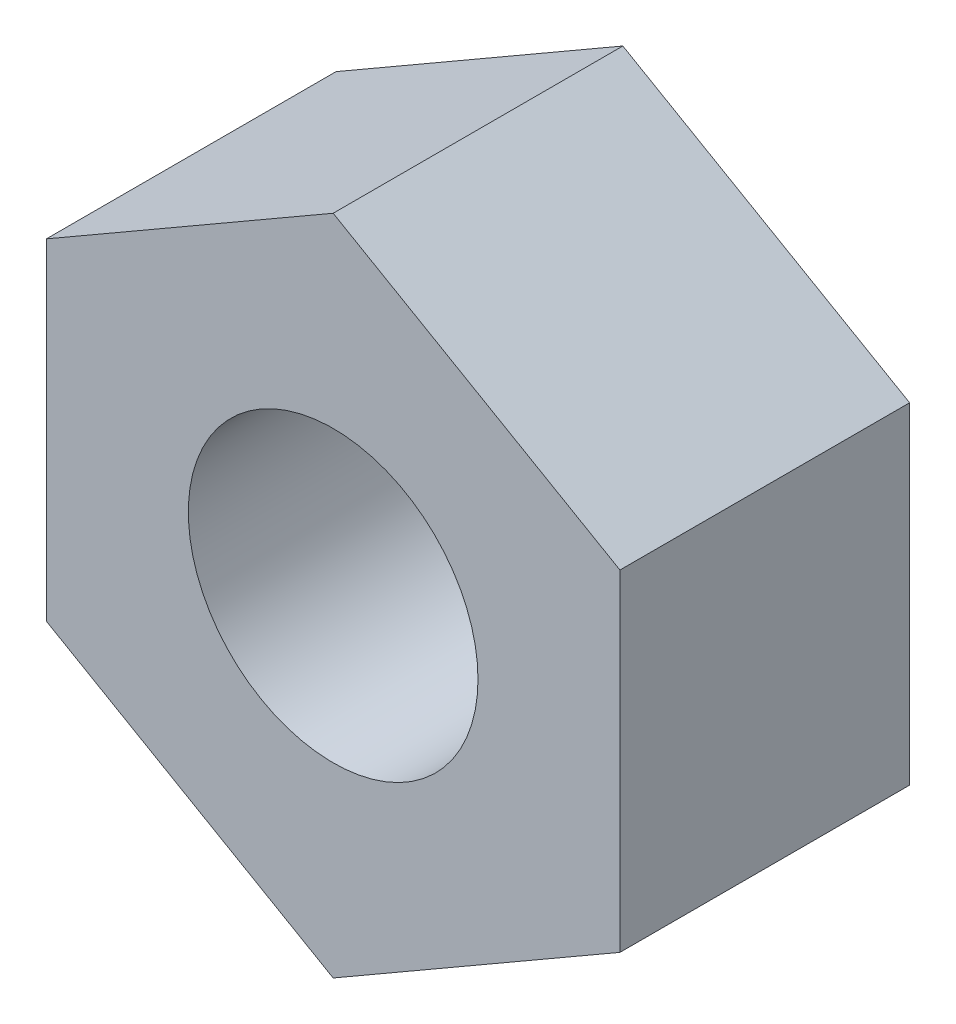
ISO-10303-21;
HEADER;
FILE_DESCRIPTION(('STEP AP214'),'2;1');
FILE_NAME('part.step','',(''),(''),'','','');
FILE_SCHEMA(('AUTOMOTIVE_DESIGN { 1 0 10303 214 1 1 1 1 }'));
ENDSEC;
DATA;
#1=APPLICATION_CONTEXT('core data for automotive mechanical design processes');
#2=APPLICATION_PROTOCOL_DEFINITION('international standard','automotive_design',2000,#1);
#3=PRODUCT_CONTEXT('',#1,'mechanical');
#4=PRODUCT('Part','Part','',(#3));
#5=PRODUCT_RELATED_PRODUCT_CATEGORY('part','',(#4));
#6=PRODUCT_DEFINITION_FORMATION('','',#4);
#7=PRODUCT_DEFINITION_CONTEXT('part definition',#1,'design');
#8=PRODUCT_DEFINITION('design','',#6,#7);
#9=PRODUCT_DEFINITION_SHAPE('','',#8);
#10=(LENGTH_UNIT() NAMED_UNIT(*) SI_UNIT(.MILLI.,.METRE.));
#11=(NAMED_UNIT(*) PLANE_ANGLE_UNIT() SI_UNIT($,.RADIAN.));
#12=(NAMED_UNIT(*) SI_UNIT($,.STERADIAN.) SOLID_ANGLE_UNIT());
#13=UNCERTAINTY_MEASURE_WITH_UNIT(LENGTH_MEASURE(1.E-05),#10,'distance_accuracy_value','');
#14=(GEOMETRIC_REPRESENTATION_CONTEXT(3) GLOBAL_UNCERTAINTY_ASSIGNED_CONTEXT((#13)) GLOBAL_UNIT_ASSIGNED_CONTEXT((#10,
#11,#12)) REPRESENTATION_CONTEXT('',''));
#15=CARTESIAN_POINT('',(0.,0.,0.));
#16=DIRECTION('',(0.,0.,1.));
#17=DIRECTION('',(1.,0.,0.));
#18=AXIS2_PLACEMENT_3D('',#15,#16,#17);
#19=CARTESIAN_POINT('',(9.9,0.,5.));
#20=DIRECTION('',(0.,0.,-1.));
#21=DIRECTION('',(-1.,0.,0.));
#22=AXIS2_PLACEMENT_3D('',#19,#20,#21);
#23=PLANE('',#22);
#24=DIRECTION('',(-0.866025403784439,0.5,0.));
#25=VECTOR('',#24,1.);
#26=CARTESIAN_POINT('',(4.95,2.85788383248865,5.));
#27=LINE('',#26,#25);
#28=CARTESIAN_POINT('',(4.95,2.85788383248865,5.));
#29=VERTEX_POINT('',#28);
#30=CARTESIAN_POINT('',(0.,5.7157676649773,5.));
#31=VERTEX_POINT('',#30);
#32=EDGE_CURVE('E112',#29,#31,#27,.T.);
#33=ORIENTED_EDGE('',*,*,#32,.T.);
#34=DIRECTION('',(-0.866025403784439,-0.5,0.));
#35=VECTOR('',#34,1.);
#36=CARTESIAN_POINT('',(0.,5.7157676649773,5.));
#37=LINE('',#36,#35);
#38=CARTESIAN_POINT('',(-4.95,2.85788383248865,5.));
#39=VERTEX_POINT('',#38);
#40=EDGE_CURVE('E93',#31,#39,#37,.T.);
#41=ORIENTED_EDGE('',*,*,#40,.T.);
#42=DIRECTION('',(0.,-1.,0.));
#43=VECTOR('',#42,1.);
#44=CARTESIAN_POINT('',(-4.95,2.85788383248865,5.));
#45=LINE('',#44,#43);
#46=CARTESIAN_POINT('',(-4.95,-2.85788383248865,5.));
#47=VERTEX_POINT('',#46);
#48=EDGE_CURVE('E115',#39,#47,#45,.T.);
#49=ORIENTED_EDGE('',*,*,#48,.T.);
#50=DIRECTION('',(0.866025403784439,-0.5,0.));
#51=VECTOR('',#50,1.);
#52=CARTESIAN_POINT('',(-4.95,-2.85788383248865,5.));
#53=LINE('',#52,#51);
#54=CARTESIAN_POINT('',(0.,-5.7157676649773,5.));
#55=VERTEX_POINT('',#54);
#56=EDGE_CURVE('E117',#47,#55,#53,.T.);
#57=ORIENTED_EDGE('',*,*,#56,.T.);
#58=DIRECTION('',(0.866025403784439,0.5,0.));
#59=VECTOR('',#58,1.);
#60=CARTESIAN_POINT('',(0.,-5.7157676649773,5.));
#61=LINE('',#60,#59);
#62=CARTESIAN_POINT('',(4.95,-2.85788383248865,5.));
#63=VERTEX_POINT('',#62);
#64=EDGE_CURVE('E46',#55,#63,#61,.T.);
#65=ORIENTED_EDGE('',*,*,#64,.T.);
#66=DIRECTION('',(0.,1.,0.));
#67=VECTOR('',#66,1.);
#68=CARTESIAN_POINT('',(4.95,-2.85788383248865,5.));
#69=LINE('',#68,#67);
#70=EDGE_CURVE('E41',#63,#29,#69,.T.);
#71=ORIENTED_EDGE('',*,*,#70,.T.);
#72=EDGE_LOOP('',(#33,#41,#49,#57,#65,#71));
#73=FACE_BOUND('',#72,.T.);
#74=CARTESIAN_POINT('',(0.,0.,5.));
#75=DIRECTION('',(0.,0.,1.));
#76=DIRECTION('',(1.,0.,0.));
#77=AXIS2_PLACEMENT_3D('',#74,#75,#76);
#78=CIRCLE('',#77,2.5);
#79=CARTESIAN_POINT('',(2.5,0.,5.));
#80=VERTEX_POINT('',#79);
#81=EDGE_CURVE('E98',#80,#80,#78,.T.);
#82=ORIENTED_EDGE('',*,*,#81,.F.);
#83=EDGE_LOOP('',(#82));
#84=FACE_BOUND('',#83,.T.);
#85=ADVANCED_FACE('F26',(#73,#84),#23,.F.);
#86=CARTESIAN_POINT('',(9.9,0.,0.));
#87=DIRECTION('',(0.,0.,-1.));
#88=DIRECTION('',(-1.,0.,0.));
#89=AXIS2_PLACEMENT_3D('',#86,#87,#88);
#90=PLANE('',#89);
#91=DIRECTION('',(-0.866025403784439,0.5,0.));
#92=VECTOR('',#91,1.);
#93=CARTESIAN_POINT('',(4.95,2.85788383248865,0.));
#94=LINE('',#93,#92);
#95=CARTESIAN_POINT('',(4.95,2.85788383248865,0.));
#96=VERTEX_POINT('',#95);
#97=CARTESIAN_POINT('',(0.,5.7157676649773,0.));
#98=VERTEX_POINT('',#97);
#99=EDGE_CURVE('E84',#96,#98,#94,.T.);
#100=ORIENTED_EDGE('',*,*,#99,.F.);
#101=DIRECTION('',(0.,1.,0.));
#102=VECTOR('',#101,1.);
#103=CARTESIAN_POINT('',(4.95,-2.85788383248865,0.));
#104=LINE('',#103,#102);
#105=CARTESIAN_POINT('',(4.95,-2.85788383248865,0.));
#106=VERTEX_POINT('',#105);
#107=EDGE_CURVE('E110',#106,#96,#104,.T.);
#108=ORIENTED_EDGE('',*,*,#107,.F.);
#109=DIRECTION('',(0.866025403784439,0.5,0.));
#110=VECTOR('',#109,1.);
#111=CARTESIAN_POINT('',(0.,-5.7157676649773,0.));
#112=LINE('',#111,#110);
#113=CARTESIAN_POINT('',(0.,-5.7157676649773,0.));
#114=VERTEX_POINT('',#113);
#115=EDGE_CURVE('E108',#114,#106,#112,.T.);
#116=ORIENTED_EDGE('',*,*,#115,.F.);
#117=DIRECTION('',(0.866025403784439,-0.5,0.));
#118=VECTOR('',#117,1.);
#119=CARTESIAN_POINT('',(-4.95,-2.85788383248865,0.));
#120=LINE('',#119,#118);
#121=CARTESIAN_POINT('',(-4.95,-2.85788383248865,0.));
#122=VERTEX_POINT('',#121);
#123=EDGE_CURVE('E106',#122,#114,#120,.T.);
#124=ORIENTED_EDGE('',*,*,#123,.F.);
#125=DIRECTION('',(0.,-1.,0.));
#126=VECTOR('',#125,1.);
#127=CARTESIAN_POINT('',(-4.95,2.85788383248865,0.));
#128=LINE('',#127,#126);
#129=CARTESIAN_POINT('',(-4.95,2.85788383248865,0.));
#130=VERTEX_POINT('',#129);
#131=EDGE_CURVE('E86',#130,#122,#128,.T.);
#132=ORIENTED_EDGE('',*,*,#131,.F.);
#133=DIRECTION('',(-0.866025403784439,-0.5,0.));
#134=VECTOR('',#133,1.);
#135=CARTESIAN_POINT('',(0.,5.7157676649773,0.));
#136=LINE('',#135,#134);
#137=EDGE_CURVE('E79',#98,#130,#136,.T.);
#138=ORIENTED_EDGE('',*,*,#137,.F.);
#139=EDGE_LOOP('',(#100,#108,#116,#124,#132,#138));
#140=FACE_BOUND('',#139,.T.);
#141=CARTESIAN_POINT('',(0.,0.,0.));
#142=DIRECTION('',(0.,0.,1.));
#143=DIRECTION('',(1.,0.,0.));
#144=AXIS2_PLACEMENT_3D('',#141,#142,#143);
#145=CIRCLE('',#144,2.5);
#146=CARTESIAN_POINT('',(2.5,0.,0.));
#147=VERTEX_POINT('',#146);
#148=EDGE_CURVE('E101',#147,#147,#145,.T.);
#149=ORIENTED_EDGE('',*,*,#148,.T.);
#150=EDGE_LOOP('',(#149));
#151=FACE_BOUND('',#150,.T.);
#152=ADVANCED_FACE('F80',(#140,#151),#90,.T.);
#153=CARTESIAN_POINT('',(4.95,2.85788383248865,5.));
#154=DIRECTION('',(-0.5,-0.866025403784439,0.));
#155=DIRECTION('',(0.866025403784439,-0.5,0.));
#156=AXIS2_PLACEMENT_3D('',#153,#154,#155);
#157=PLANE('',#156);
#158=ORIENTED_EDGE('',*,*,#99,.T.);
#159=DIRECTION('',(0.,0.,-1.));
#160=VECTOR('',#159,1.);
#161=CARTESIAN_POINT('',(0.,5.7157676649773,5.));
#162=LINE('',#161,#160);
#163=EDGE_CURVE('E11',#31,#98,#162,.T.);
#164=ORIENTED_EDGE('',*,*,#163,.F.);
#165=ORIENTED_EDGE('',*,*,#32,.F.);
#166=DIRECTION('',(0.,0.,-1.));
#167=VECTOR('',#166,1.);
#168=CARTESIAN_POINT('',(4.95,2.85788383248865,5.));
#169=LINE('',#168,#167);
#170=EDGE_CURVE('E97',#29,#96,#169,.T.);
#171=ORIENTED_EDGE('',*,*,#170,.T.);
#172=EDGE_LOOP('',(#158,#164,#165,#171));
#173=FACE_BOUND('',#172,.T.);
#174=ADVANCED_FACE('F28',(#173),#157,.F.);
#175=CARTESIAN_POINT('',(0.,5.7157676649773,5.));
#176=DIRECTION('',(0.5,-0.866025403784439,0.));
#177=DIRECTION('',(0.866025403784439,0.5,0.));
#178=AXIS2_PLACEMENT_3D('',#175,#176,#177);
#179=PLANE('',#178);
#180=ORIENTED_EDGE('',*,*,#137,.T.);
#181=DIRECTION('',(0.,0.,-1.));
#182=VECTOR('',#181,1.);
#183=CARTESIAN_POINT('',(-4.95,2.85788383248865,5.));
#184=LINE('',#183,#182);
#185=EDGE_CURVE('E34',#39,#130,#184,.T.);
#186=ORIENTED_EDGE('',*,*,#185,.F.);
#187=ORIENTED_EDGE('',*,*,#40,.F.);
#188=ORIENTED_EDGE('',*,*,#163,.T.);
#189=EDGE_LOOP('',(#180,#186,#187,#188));
#190=FACE_BOUND('',#189,.T.);
#191=ADVANCED_FACE('F92',(#190),#179,.F.);
#192=CARTESIAN_POINT('',(-4.95,2.85788383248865,5.));
#193=DIRECTION('',(1.,0.,0.));
#194=DIRECTION('',(0.,1.,0.));
#195=AXIS2_PLACEMENT_3D('',#192,#193,#194);
#196=PLANE('',#195);
#197=ORIENTED_EDGE('',*,*,#131,.T.);
#198=DIRECTION('',(0.,0.,-1.));
#199=VECTOR('',#198,1.);
#200=CARTESIAN_POINT('',(-4.95,-2.85788383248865,5.));
#201=LINE('',#200,#199);
#202=EDGE_CURVE('E128',#47,#122,#201,.T.);
#203=ORIENTED_EDGE('',*,*,#202,.F.);
#204=ORIENTED_EDGE('',*,*,#48,.F.);
#205=ORIENTED_EDGE('',*,*,#185,.T.);
#206=EDGE_LOOP('',(#197,#203,#204,#205));
#207=FACE_BOUND('',#206,.T.);
#208=ADVANCED_FACE('F132',(#207),#196,.F.);
#209=CARTESIAN_POINT('',(-4.95,-2.85788383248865,5.));
#210=DIRECTION('',(0.5,0.866025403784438,0.));
#211=DIRECTION('',(-0.866025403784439,0.5,0.));
#212=AXIS2_PLACEMENT_3D('',#209,#210,#211);
#213=PLANE('',#212);
#214=ORIENTED_EDGE('',*,*,#123,.T.);
#215=DIRECTION('',(0.,0.,-1.));
#216=VECTOR('',#215,1.);
#217=CARTESIAN_POINT('',(0.,-5.7157676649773,5.));
#218=LINE('',#217,#216);
#219=EDGE_CURVE('E125',#55,#114,#218,.T.);
#220=ORIENTED_EDGE('',*,*,#219,.F.);
#221=ORIENTED_EDGE('',*,*,#56,.F.);
#222=ORIENTED_EDGE('',*,*,#202,.T.);
#223=EDGE_LOOP('',(#214,#220,#221,#222));
#224=FACE_BOUND('',#223,.T.);
#225=ADVANCED_FACE('F138',(#224),#213,.F.);
#226=CARTESIAN_POINT('',(0.,-5.7157676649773,5.));
#227=DIRECTION('',(-0.5,0.866025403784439,0.));
#228=DIRECTION('',(-0.866025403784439,-0.5,0.));
#229=AXIS2_PLACEMENT_3D('',#226,#227,#228);
#230=PLANE('',#229);
#231=ORIENTED_EDGE('',*,*,#115,.T.);
#232=DIRECTION('',(0.,0.,-1.));
#233=VECTOR('',#232,1.);
#234=CARTESIAN_POINT('',(4.95,-2.85788383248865,5.));
#235=LINE('',#234,#233);
#236=EDGE_CURVE('E122',#63,#106,#235,.T.);
#237=ORIENTED_EDGE('',*,*,#236,.F.);
#238=ORIENTED_EDGE('',*,*,#64,.F.);
#239=ORIENTED_EDGE('',*,*,#219,.T.);
#240=EDGE_LOOP('',(#231,#237,#238,#239));
#241=FACE_BOUND('',#240,.T.);
#242=ADVANCED_FACE('F141',(#241),#230,.F.);
#243=CARTESIAN_POINT('',(4.95,-2.85788383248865,5.));
#244=DIRECTION('',(-1.,0.,0.));
#245=DIRECTION('',(0.,0.,1.));
#246=AXIS2_PLACEMENT_3D('',#243,#244,#245);
#247=PLANE('',#246);
#248=ORIENTED_EDGE('',*,*,#107,.T.);
#249=ORIENTED_EDGE('',*,*,#170,.F.);
#250=ORIENTED_EDGE('',*,*,#70,.F.);
#251=ORIENTED_EDGE('',*,*,#236,.T.);
#252=EDGE_LOOP('',(#248,#249,#250,#251));
#253=FACE_BOUND('',#252,.T.);
#254=ADVANCED_FACE('F143',(#253),#247,.F.);
#255=CARTESIAN_POINT('',(0.,0.,5.));
#256=DIRECTION('',(0.,0.,-1.));
#257=DIRECTION('',(-1.,0.,0.));
#258=AXIS2_PLACEMENT_3D('',#255,#256,#257);
#259=CYLINDRICAL_SURFACE('',#258,2.5);
#260=ORIENTED_EDGE('',*,*,#81,.T.);
#261=EDGE_LOOP('',(#260));
#262=FACE_BOUND('',#261,.T.);
#263=ORIENTED_EDGE('',*,*,#148,.F.);
#264=EDGE_LOOP('',(#263));
#265=FACE_BOUND('',#264,.T.);
#266=ADVANCED_FACE('F145',(#262,#265),#259,.F.);
#267=CLOSED_SHELL('',(#85,#152,#174,#191,#208,#225,#242,#254,#266));
#268=MANIFOLD_SOLID_BREP('B2',#267);
#269=ADVANCED_BREP_SHAPE_REPRESENTATION('',(#18,#268),#14);
#270=SHAPE_DEFINITION_REPRESENTATION(#9,#269);
ENDSEC;
END-ISO-10303-21;
